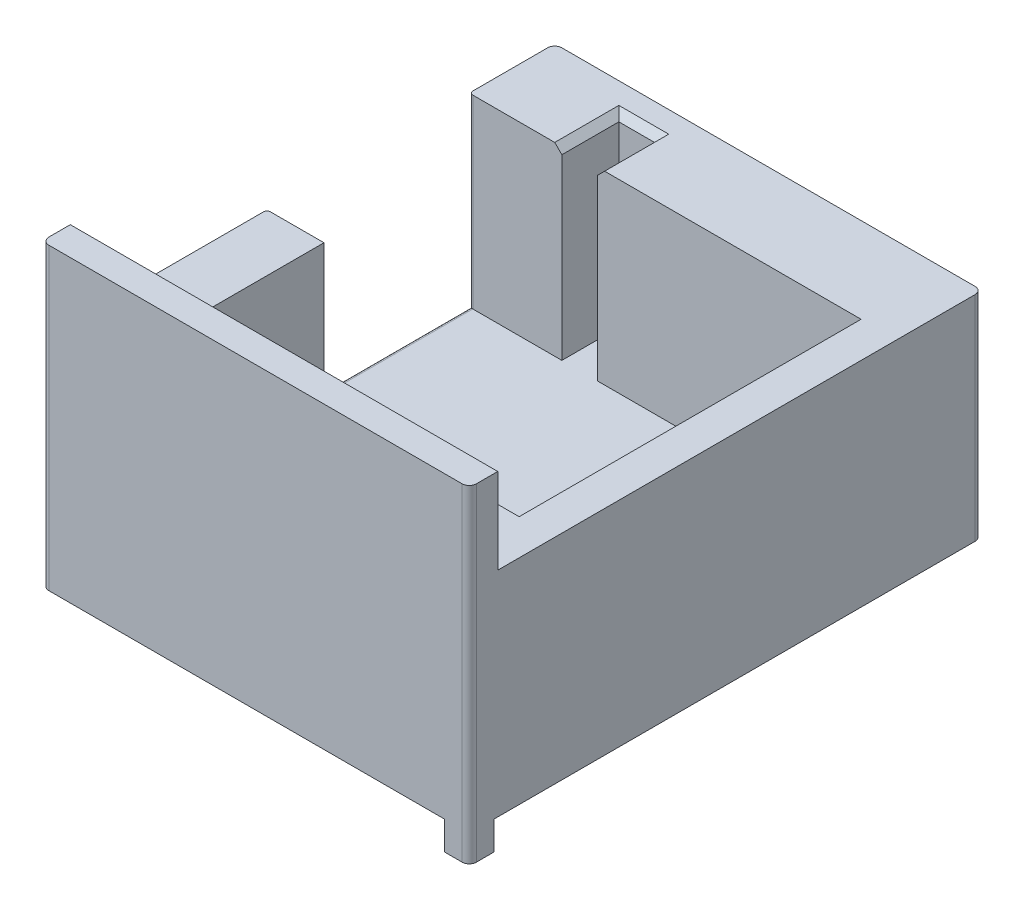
from build123d import *

# Parameters (mm, degrees)
SKETCH_1_W          = 30
SKETCH_1_H          = 36
EXTRUDE_1_DEPTH     = 15
CUT_EXTRUDE_3_DEPTH = 13
CUT_EXTRUDE_5_REACH = 40.066
SKETCH_7_W          = 2
SKETCH_7_H          = 2
EXTRUDE_2_DEPTH     = 2
SKETCH_8_W          = 2
SKETCH_8_H          = 6
EXTRUDE_3_DEPTH     = 30
CHAMFER_1_SIZE      = 0.5
FILLET_1_R          = 0.5
CHAMFER_2_SIZE      = 0.25
SKETCH_9_W          = 3
SKETCH_9_H          = 24
CUT_EXTRUDE_6_DEPTH = 10
CUT_EXTRUDE_7_REACH = 42.804
SKETCH_10_W         = 14.196152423
SKETCH_10_H         = 13
FILLET_2_R          = 0.25


with BuildPart() as part:
    # Sketch 1 → Extrude 1 (new body)
    with BuildSketch(Plane(origin=(0, 0, 0), x_dir=(1, 0, 0), z_dir=(0, 1, 0))):
        Rectangle(SKETCH_1_W, SKETCH_1_H)
    extrude(amount=EXTRUDE_1_DEPTH)

    # Sketch 4 → Cut-Extrude 3 (cut)
    with BuildSketch(Plane(origin=(0, 15, 0), x_dir=(1, 0, 0), z_dir=(0, 1, 0))):
        Polygon((12.5, 12), (12.5, -12), (-6, -12), (-6, -16), (-8.5, -16), (-8.5, -12), (-11, -12), (-11, 12), (-8.5, 12), (-8.5, 16), (-6, 16), (-6, 12), align=None)
    extrude(amount=-CUT_EXTRUDE_3_DEPTH, mode=Mode.SUBTRACT)

    # Sketch 6 → Cut-Extrude 5 (cut, up to next)
    with BuildSketch(Plane.ZY.offset(15), mode=Mode.PRIVATE) as cut_extrude_5_sk1:
        with BuildLine():
            Line((2.196152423, 8.15), (2.196152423, 15))
            Line((2.196152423, 15), (-12, 15))
            Line((-12, 15), (-12, 8.15))
            ThreePointArc((-12, 8.15), (-7.552914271, 2.354445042), (-0.803847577, 5.15))
            ThreePointArc((-0.803847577, 5.15), (1.317472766, 6.028679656), (2.196152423, 8.15))
        make_face()
    cut_extrude_5_tool1 = extrude(cut_extrude_5_sk1.sketch, amount=-CUT_EXTRUDE_5_REACH, mode=Mode.PRIVATE) & part.part
    add(cut_extrude_5_tool1.solids().sort_by_distance((-15, 9.292442, -5.098725))[0], mode=Mode.SUBTRACT)

    # Sketch 7 → Extrude 2 (add)
    with BuildSketch(Plane.XZ):
        with Locations((14, 17)):
            Rectangle(SKETCH_7_W, SKETCH_7_H)
    extrude(amount=EXTRUDE_2_DEPTH)

    # Sketch 8 → Extrude 3 (add)
    with BuildSketch(Plane(origin=(15, 0, 0), x_dir=(0, 0, -1), z_dir=(1, 0, 0))):
        with Locations((-17, 18)):
            Rectangle(SKETCH_8_W, SKETCH_8_H)
    extrude(amount=-EXTRUDE_3_DEPTH)

    # Chamfer 1
    chamfer_1_edges = [part.edges().sort_by_distance(p)[0] for p in [
        (-6, 15, -14),
        (-8.5, 15, -14),
        (-7.25, 15, -16),
        (-8.5, 15, 14),
        (-6, 15, 14),
    ]]
    chamfer(chamfer_1_edges, length=CHAMFER_1_SIZE)

    # Fillet 1
    fillet_1_edges = [part.edges().sort_by_distance(p)[0] for p in [
        (-15, 7.5, -18),
        (15, 7.5, -18),
        (-15, 10.5, 18),
        (15, 9.5, 18),
    ]]
    fillet(fillet_1_edges, radius=FILLET_1_R)

    # Chamfer 2
    chamfer_2_edges = [part.edges().sort_by_distance(p)[0] for p in [
        (13, -1, 18),
        (13, -1, 16),
        (15, -1, 16),
    ]]
    chamfer(chamfer_2_edges, length=CHAMFER_2_SIZE)

    # Sketch 9 → Cut-Extrude 6 (cut)
    with BuildSketch(Plane(origin=(0, 2, 0), x_dir=(1, 0, 0), z_dir=(0, 1, 0))):
        with Locations((11, 0)):
            Rectangle(SKETCH_9_W, SKETCH_9_H)
    extrude(amount=-CUT_EXTRUDE_6_DEPTH, mode=Mode.SUBTRACT)

    # Sketch 10 → Cut-Extrude 7 (cut, up to next)
    with BuildSketch(Plane.ZY.offset(15), mode=Mode.PRIVATE) as cut_extrude_7_sk1:
        with Locations((-4.901923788, 8.5)):
            Rectangle(SKETCH_10_W, SKETCH_10_H)
    cut_extrude_7_tool1 = extrude(cut_extrude_7_sk1.sketch, amount=-CUT_EXTRUDE_7_REACH, mode=Mode.PRIVATE) & part.part
    add(cut_extrude_7_tool1.solids().sort_by_distance((-15, 8.5, -4.901924))[0], mode=Mode.SUBTRACT)

    # Fillet 2
    fillet_2_edges = [part.edges().sort_by_distance(p)[0] for p in [
        (-15, 8.5, 2.196152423),
        (-15, 8.5, -12),
        (-15, 2, -4.901923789),
    ]]
    fillet(fillet_2_edges, radius=FILLET_2_R)


solid = part.part
